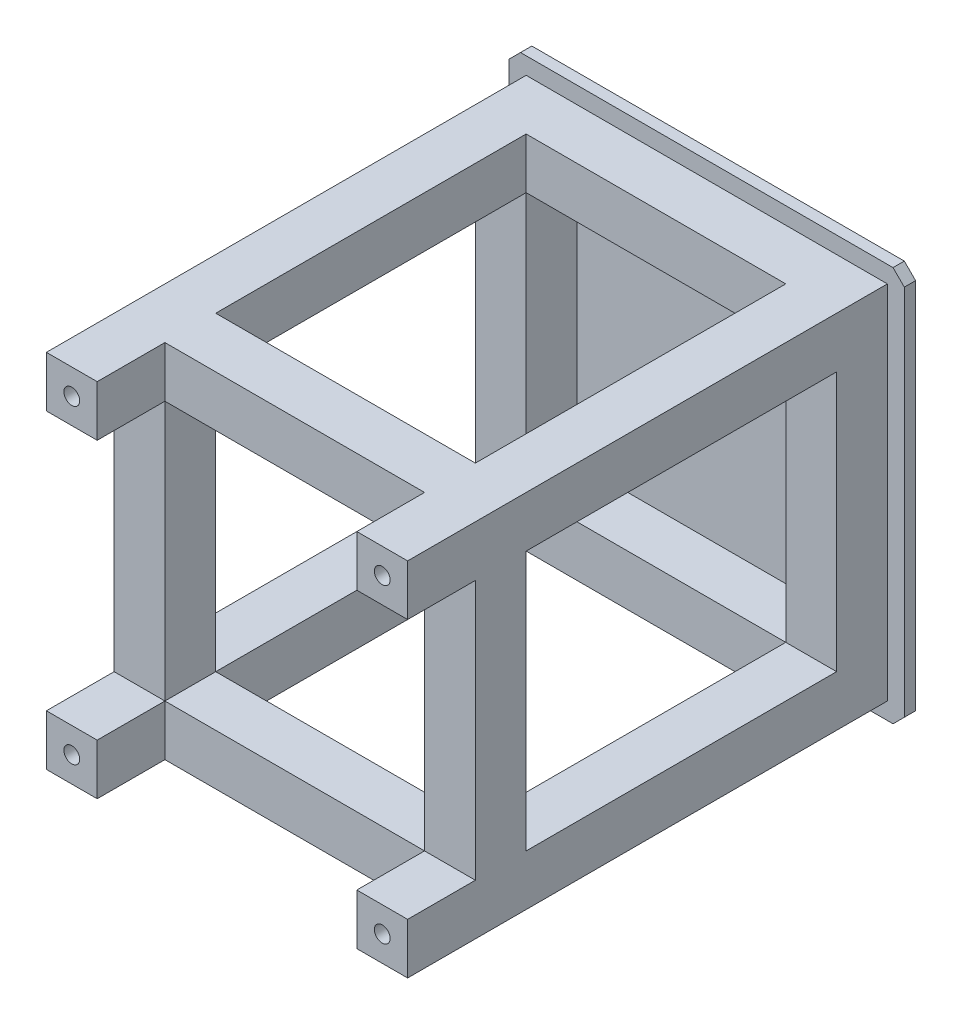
ISO-10303-21;
HEADER;
FILE_DESCRIPTION(('STEP AP214'),'2;1');
FILE_NAME('part.step','',(''),(''),'','','');
FILE_SCHEMA(('AUTOMOTIVE_DESIGN { 1 0 10303 214 1 1 1 1 }'));
ENDSEC;
DATA;
#1=APPLICATION_CONTEXT('core data for automotive mechanical design processes');
#2=APPLICATION_PROTOCOL_DEFINITION('international standard','automotive_design',2000,#1);
#3=PRODUCT_CONTEXT('',#1,'mechanical');
#4=PRODUCT('Part','Part','',(#3));
#5=PRODUCT_RELATED_PRODUCT_CATEGORY('part','',(#4));
#6=PRODUCT_DEFINITION_FORMATION('','',#4);
#7=PRODUCT_DEFINITION_CONTEXT('part definition',#1,'design');
#8=PRODUCT_DEFINITION('design','',#6,#7);
#9=PRODUCT_DEFINITION_SHAPE('','',#8);
#10=(LENGTH_UNIT() NAMED_UNIT(*) SI_UNIT(.MILLI.,.METRE.));
#11=(NAMED_UNIT(*) PLANE_ANGLE_UNIT() SI_UNIT($,.RADIAN.));
#12=(NAMED_UNIT(*) SI_UNIT($,.STERADIAN.) SOLID_ANGLE_UNIT());
#13=UNCERTAINTY_MEASURE_WITH_UNIT(LENGTH_MEASURE(1.E-05),#10,'distance_accuracy_value','');
#14=(GEOMETRIC_REPRESENTATION_CONTEXT(3) GLOBAL_UNCERTAINTY_ASSIGNED_CONTEXT((#13)) GLOBAL_UNIT_ASSIGNED_CONTEXT((#10,
#11,#12)) REPRESENTATION_CONTEXT('',''));
#15=CARTESIAN_POINT('',(0.,0.,0.));
#16=DIRECTION('',(0.,0.,1.));
#17=DIRECTION('',(1.,0.,0.));
#18=AXIS2_PLACEMENT_3D('',#15,#16,#17);
#19=CARTESIAN_POINT('',(-160.,115.,435.));
#20=DIRECTION('',(0.,1.,0.));
#21=DIRECTION('',(-1.,0.,0.));
#22=AXIS2_PLACEMENT_3D('',#19,#20,#21);
#23=PLANE('',#22);
#24=DIRECTION('',(-1.,0.,0.));
#25=VECTOR('',#24,1.);
#26=CARTESIAN_POINT('',(-160.,115.,375.));
#27=LINE('',#26,#25);
#28=CARTESIAN_POINT('',(-115.,115.,375.));
#29=VERTEX_POINT('',#28);
#30=CARTESIAN_POINT('',(-160.,115.,375.));
#31=VERTEX_POINT('',#30);
#32=EDGE_CURVE('E267',#29,#31,#27,.T.);
#33=ORIENTED_EDGE('',*,*,#32,.F.);
#34=DIRECTION('',(0.,0.,-1.));
#35=VECTOR('',#34,1.);
#36=CARTESIAN_POINT('',(-115.,115.,435.));
#37=LINE('',#36,#35);
#38=CARTESIAN_POINT('',(-115.,115.,435.));
#39=VERTEX_POINT('',#38);
#40=EDGE_CURVE('E340',#39,#29,#37,.T.);
#41=ORIENTED_EDGE('',*,*,#40,.F.);
#42=DIRECTION('',(1.,0.,0.));
#43=VECTOR('',#42,1.);
#44=CARTESIAN_POINT('',(-160.,115.,435.));
#45=LINE('',#44,#43);
#46=CARTESIAN_POINT('',(-160.,115.,435.));
#47=VERTEX_POINT('',#46);
#48=EDGE_CURVE('E329',#47,#39,#45,.T.);
#49=ORIENTED_EDGE('',*,*,#48,.F.);
#50=DIRECTION('',(0.,0.,-1.));
#51=VECTOR('',#50,1.);
#52=CARTESIAN_POINT('',(-160.,115.,435.));
#53=LINE('',#52,#51);
#54=EDGE_CURVE('E361',#47,#31,#53,.T.);
#55=ORIENTED_EDGE('',*,*,#54,.T.);
#56=EDGE_LOOP('',(#33,#41,#49,#55));
#57=FACE_BOUND('',#56,.T.);
#58=ADVANCED_FACE('F16',(#57),#23,.F.);
#59=DIRECTION('',(0.,0.,-1.));
#60=VECTOR('',#59,1.);
#61=CARTESIAN_POINT('',(-115.,115.,375.));
#62=LINE('',#61,#60);
#63=CARTESIAN_POINT('',(-115.,115.,330.));
#64=VERTEX_POINT('',#63);
#65=EDGE_CURVE('E550',#29,#64,#62,.T.);
#66=ORIENTED_EDGE('',*,*,#65,.T.);
#67=DIRECTION('',(1.,0.,0.));
#68=VECTOR('',#67,1.);
#69=CARTESIAN_POINT('',(-160.,115.,330.));
#70=LINE('',#69,#68);
#71=CARTESIAN_POINT('',(115.,115.,330.));
#72=VERTEX_POINT('',#71);
#73=EDGE_CURVE('E534',#64,#72,#70,.T.);
#74=ORIENTED_EDGE('',*,*,#73,.T.);
#75=DIRECTION('',(0.,0.,-1.));
#76=VECTOR('',#75,1.);
#77=CARTESIAN_POINT('',(115.,115.,375.));
#78=LINE('',#77,#76);
#79=CARTESIAN_POINT('',(115.,115.,375.));
#80=VERTEX_POINT('',#79);
#81=EDGE_CURVE('E589',#80,#72,#78,.T.);
#82=ORIENTED_EDGE('',*,*,#81,.F.);
#83=DIRECTION('',(1.,0.,0.));
#84=VECTOR('',#83,1.);
#85=CARTESIAN_POINT('',(-160.,115.,375.));
#86=LINE('',#85,#84);
#87=EDGE_CURVE('E613',#29,#80,#86,.T.);
#88=ORIENTED_EDGE('',*,*,#87,.F.);
#89=EDGE_LOOP('',(#66,#74,#82,#88));
#90=FACE_BOUND('',#89,.T.);
#91=ADVANCED_FACE('F478',(#90),#23,.F.);
#92=CARTESIAN_POINT('',(-160.,-115.,435.));
#93=DIRECTION('',(0.,-1.,0.));
#94=DIRECTION('',(1.,0.,0.));
#95=AXIS2_PLACEMENT_3D('',#92,#93,#94);
#96=PLANE('',#95);
#97=DIRECTION('',(1.,0.,0.));
#98=VECTOR('',#97,1.);
#99=CARTESIAN_POINT('',(-160.,-115.,375.));
#100=LINE('',#99,#98);
#101=CARTESIAN_POINT('',(-160.,-115.,375.));
#102=VERTEX_POINT('',#101);
#103=CARTESIAN_POINT('',(-115.,-115.,375.));
#104=VERTEX_POINT('',#103);
#105=EDGE_CURVE('E265',#102,#104,#100,.T.);
#106=ORIENTED_EDGE('',*,*,#105,.F.);
#107=DIRECTION('',(0.,0.,-1.));
#108=VECTOR('',#107,1.);
#109=CARTESIAN_POINT('',(-160.,-115.,435.));
#110=LINE('',#109,#108);
#111=CARTESIAN_POINT('',(-160.,-115.,435.));
#112=VERTEX_POINT('',#111);
#113=EDGE_CURVE('E277',#112,#102,#110,.T.);
#114=ORIENTED_EDGE('',*,*,#113,.F.);
#115=DIRECTION('',(-1.,0.,0.));
#116=VECTOR('',#115,1.);
#117=CARTESIAN_POINT('',(-160.,-115.,435.));
#118=LINE('',#117,#116);
#119=CARTESIAN_POINT('',(-115.,-115.,435.));
#120=VERTEX_POINT('',#119);
#121=EDGE_CURVE('E291',#120,#112,#118,.T.);
#122=ORIENTED_EDGE('',*,*,#121,.F.);
#123=DIRECTION('',(0.,0.,-1.));
#124=VECTOR('',#123,1.);
#125=CARTESIAN_POINT('',(-115.,-115.,435.));
#126=LINE('',#125,#124);
#127=EDGE_CURVE('E280',#120,#104,#126,.T.);
#128=ORIENTED_EDGE('',*,*,#127,.T.);
#129=EDGE_LOOP('',(#106,#114,#122,#128));
#130=FACE_BOUND('',#129,.T.);
#131=ADVANCED_FACE('F275',(#130),#96,.F.);
#132=DIRECTION('',(0.,0.,-1.));
#133=VECTOR('',#132,1.);
#134=CARTESIAN_POINT('',(-115.,-115.,375.));
#135=LINE('',#134,#133);
#136=CARTESIAN_POINT('',(-115.,-115.,330.));
#137=VERTEX_POINT('',#136);
#138=EDGE_CURVE('E552',#104,#137,#135,.T.);
#139=ORIENTED_EDGE('',*,*,#138,.F.);
#140=DIRECTION('',(-1.,0.,0.));
#141=VECTOR('',#140,1.);
#142=CARTESIAN_POINT('',(-160.,-115.,375.));
#143=LINE('',#142,#141);
#144=CARTESIAN_POINT('',(115.,-115.,375.));
#145=VERTEX_POINT('',#144);
#146=EDGE_CURVE('E596',#145,#104,#143,.T.);
#147=ORIENTED_EDGE('',*,*,#146,.F.);
#148=DIRECTION('',(0.,0.,-1.));
#149=VECTOR('',#148,1.);
#150=CARTESIAN_POINT('',(115.,-115.,375.));
#151=LINE('',#150,#149);
#152=CARTESIAN_POINT('',(115.,-115.,330.));
#153=VERTEX_POINT('',#152);
#154=EDGE_CURVE('E577',#145,#153,#151,.T.);
#155=ORIENTED_EDGE('',*,*,#154,.T.);
#156=DIRECTION('',(-1.,0.,0.));
#157=VECTOR('',#156,1.);
#158=CARTESIAN_POINT('',(-160.,-115.,330.));
#159=LINE('',#158,#157);
#160=EDGE_CURVE('E597',#153,#137,#159,.T.);
#161=ORIENTED_EDGE('',*,*,#160,.T.);
#162=EDGE_LOOP('',(#139,#147,#155,#161));
#163=FACE_BOUND('',#162,.T.);
#164=ADVANCED_FACE('F517',(#163),#96,.F.);
#165=DIRECTION('',(-1.,0.,0.));
#166=VECTOR('',#165,1.);
#167=CARTESIAN_POINT('',(160.,115.,375.));
#168=LINE('',#167,#166);
#169=CARTESIAN_POINT('',(160.,115.,375.));
#170=VERTEX_POINT('',#169);
#171=EDGE_CURVE('E570',#170,#80,#168,.T.);
#172=ORIENTED_EDGE('',*,*,#171,.F.);
#173=DIRECTION('',(0.,0.,-1.));
#174=VECTOR('',#173,1.);
#175=CARTESIAN_POINT('',(160.,115.,435.));
#176=LINE('',#175,#174);
#177=CARTESIAN_POINT('',(160.,115.,435.));
#178=VERTEX_POINT('',#177);
#179=EDGE_CURVE('E315',#178,#170,#176,.T.);
#180=ORIENTED_EDGE('',*,*,#179,.F.);
#181=DIRECTION('',(1.,0.,0.));
#182=VECTOR('',#181,1.);
#183=CARTESIAN_POINT('',(160.,115.,435.));
#184=LINE('',#183,#182);
#185=CARTESIAN_POINT('',(115.,115.,435.));
#186=VERTEX_POINT('',#185);
#187=EDGE_CURVE('E308',#186,#178,#184,.T.);
#188=ORIENTED_EDGE('',*,*,#187,.F.);
#189=DIRECTION('',(0.,0.,-1.));
#190=VECTOR('',#189,1.);
#191=CARTESIAN_POINT('',(115.,115.,435.));
#192=LINE('',#191,#190);
#193=EDGE_CURVE('E319',#186,#80,#192,.T.);
#194=ORIENTED_EDGE('',*,*,#193,.T.);
#195=EDGE_LOOP('',(#172,#180,#188,#194));
#196=FACE_BOUND('',#195,.T.);
#197=ADVANCED_FACE('F487',(#196),#23,.F.);
#198=CARTESIAN_POINT('',(-115.,115.,55.));
#199=VERTEX_POINT('',#198);
#200=EDGE_CURVE('E351',#64,#199,#37,.T.);
#201=ORIENTED_EDGE('',*,*,#200,.F.);
#202=DIRECTION('',(-1.,0.,0.));
#203=VECTOR('',#202,1.);
#204=CARTESIAN_POINT('',(-160.,115.,330.));
#205=LINE('',#204,#203);
#206=CARTESIAN_POINT('',(-160.,115.,330.));
#207=VERTEX_POINT('',#206);
#208=EDGE_CURVE('E524',#64,#207,#205,.T.);
#209=ORIENTED_EDGE('',*,*,#208,.T.);
#210=CARTESIAN_POINT('',(-160.,115.,55.));
#211=VERTEX_POINT('',#210);
#212=EDGE_CURVE('E359',#207,#211,#53,.T.);
#213=ORIENTED_EDGE('',*,*,#212,.T.);
#214=DIRECTION('',(1.,0.,0.));
#215=VECTOR('',#214,1.);
#216=CARTESIAN_POINT('',(-160.,115.,55.));
#217=LINE('',#216,#215);
#218=EDGE_CURVE('E325',#211,#199,#217,.T.);
#219=ORIENTED_EDGE('',*,*,#218,.T.);
#220=EDGE_LOOP('',(#201,#209,#213,#219));
#221=FACE_BOUND('',#220,.T.);
#222=ADVANCED_FACE('F494',(#221),#23,.F.);
#223=DIRECTION('',(1.,0.,0.));
#224=VECTOR('',#223,1.);
#225=CARTESIAN_POINT('',(160.,-115.,375.));
#226=LINE('',#225,#224);
#227=CARTESIAN_POINT('',(160.,-115.,375.));
#228=VERTEX_POINT('',#227);
#229=EDGE_CURVE('E575',#145,#228,#226,.T.);
#230=ORIENTED_EDGE('',*,*,#229,.F.);
#231=DIRECTION('',(0.,0.,-1.));
#232=VECTOR('',#231,1.);
#233=CARTESIAN_POINT('',(115.,-115.,435.));
#234=LINE('',#233,#232);
#235=CARTESIAN_POINT('',(115.,-115.,435.));
#236=VERTEX_POINT('',#235);
#237=EDGE_CURVE('E668',#236,#145,#234,.T.);
#238=ORIENTED_EDGE('',*,*,#237,.F.);
#239=DIRECTION('',(-1.,0.,0.));
#240=VECTOR('',#239,1.);
#241=CARTESIAN_POINT('',(115.,-115.,435.));
#242=LINE('',#241,#240);
#243=CARTESIAN_POINT('',(160.,-115.,435.));
#244=VERTEX_POINT('',#243);
#245=EDGE_CURVE('E661',#244,#236,#242,.T.);
#246=ORIENTED_EDGE('',*,*,#245,.F.);
#247=DIRECTION('',(0.,0.,-1.));
#248=VECTOR('',#247,1.);
#249=CARTESIAN_POINT('',(160.,-115.,435.));
#250=LINE('',#249,#248);
#251=EDGE_CURVE('E672',#244,#228,#250,.T.);
#252=ORIENTED_EDGE('',*,*,#251,.T.);
#253=EDGE_LOOP('',(#230,#238,#246,#252));
#254=FACE_BOUND('',#253,.T.);
#255=ADVANCED_FACE('F507',(#254),#96,.F.);
#256=CARTESIAN_POINT('',(-160.,-115.,330.));
#257=VERTEX_POINT('',#256);
#258=CARTESIAN_POINT('',(-160.,-115.,55.));
#259=VERTEX_POINT('',#258);
#260=EDGE_CURVE('E288',#257,#259,#110,.T.);
#261=ORIENTED_EDGE('',*,*,#260,.F.);
#262=DIRECTION('',(1.,0.,0.));
#263=VECTOR('',#262,1.);
#264=CARTESIAN_POINT('',(-160.,-115.,330.));
#265=LINE('',#264,#263);
#266=EDGE_CURVE('E555',#257,#137,#265,.T.);
#267=ORIENTED_EDGE('',*,*,#266,.T.);
#268=CARTESIAN_POINT('',(-115.,-115.,55.));
#269=VERTEX_POINT('',#268);
#270=EDGE_CURVE('E287',#137,#269,#126,.T.);
#271=ORIENTED_EDGE('',*,*,#270,.T.);
#272=DIRECTION('',(-1.,0.,0.));
#273=VECTOR('',#272,1.);
#274=CARTESIAN_POINT('',(-160.,-115.,55.));
#275=LINE('',#274,#273);
#276=EDGE_CURVE('E293',#269,#259,#275,.T.);
#277=ORIENTED_EDGE('',*,*,#276,.T.);
#278=EDGE_LOOP('',(#261,#267,#271,#277));
#279=FACE_BOUND('',#278,.T.);
#280=ADVANCED_FACE('F514',(#279),#96,.F.);
#281=CARTESIAN_POINT('',(-115.,-160.,435.));
#282=DIRECTION('',(-1.,0.,0.));
#283=DIRECTION('',(0.,0.,1.));
#284=AXIS2_PLACEMENT_3D('',#281,#282,#283);
#285=PLANE('',#284);
#286=DIRECTION('',(0.,1.,0.));
#287=VECTOR('',#286,1.);
#288=CARTESIAN_POINT('',(-115.,-160.,330.));
#289=LINE('',#288,#287);
#290=CARTESIAN_POINT('',(-115.,-160.,330.));
#291=VERTEX_POINT('',#290);
#292=EDGE_CURVE('E543',#291,#137,#289,.T.);
#293=ORIENTED_EDGE('',*,*,#292,.F.);
#294=DIRECTION('',(0.,0.,-1.));
#295=VECTOR('',#294,1.);
#296=CARTESIAN_POINT('',(-115.,-160.,435.));
#297=LINE('',#296,#295);
#298=CARTESIAN_POINT('',(-115.,-160.,55.));
#299=VERTEX_POINT('',#298);
#300=EDGE_CURVE('E296',#291,#299,#297,.T.);
#301=ORIENTED_EDGE('',*,*,#300,.T.);
#302=DIRECTION('',(0.,1.,0.));
#303=VECTOR('',#302,1.);
#304=CARTESIAN_POINT('',(-115.,-160.,55.));
#305=LINE('',#304,#303);
#306=EDGE_CURVE('E679',#299,#269,#305,.T.);
#307=ORIENTED_EDGE('',*,*,#306,.T.);
#308=ORIENTED_EDGE('',*,*,#270,.F.);
#309=EDGE_LOOP('',(#293,#301,#307,#308));
#310=FACE_BOUND('',#309,.T.);
#311=ADVANCED_FACE('F792',(#310),#285,.F.);
#312=CARTESIAN_POINT('',(115.,-115.,435.));
#313=DIRECTION('',(1.,0.,0.));
#314=DIRECTION('',(0.,0.,-1.));
#315=AXIS2_PLACEMENT_3D('',#312,#313,#314);
#316=PLANE('',#315);
#317=DIRECTION('',(0.,-1.,0.));
#318=VECTOR('',#317,1.);
#319=CARTESIAN_POINT('',(115.,-115.,330.));
#320=LINE('',#319,#318);
#321=CARTESIAN_POINT('',(115.,-160.,330.));
#322=VERTEX_POINT('',#321);
#323=EDGE_CURVE('E608',#153,#322,#320,.T.);
#324=ORIENTED_EDGE('',*,*,#323,.F.);
#325=CARTESIAN_POINT('',(115.,-115.,55.));
#326=VERTEX_POINT('',#325);
#327=EDGE_CURVE('E663',#153,#326,#234,.T.);
#328=ORIENTED_EDGE('',*,*,#327,.T.);
#329=DIRECTION('',(0.,-1.,0.));
#330=VECTOR('',#329,1.);
#331=CARTESIAN_POINT('',(115.,-115.,55.));
#332=LINE('',#331,#330);
#333=CARTESIAN_POINT('',(115.,-160.,55.));
#334=VERTEX_POINT('',#333);
#335=EDGE_CURVE('E651',#326,#334,#332,.T.);
#336=ORIENTED_EDGE('',*,*,#335,.T.);
#337=DIRECTION('',(0.,0.,-1.));
#338=VECTOR('',#337,1.);
#339=CARTESIAN_POINT('',(115.,-160.,435.));
#340=LINE('',#339,#338);
#341=EDGE_CURVE('E675',#322,#334,#340,.T.);
#342=ORIENTED_EDGE('',*,*,#341,.F.);
#343=EDGE_LOOP('',(#324,#328,#336,#342));
#344=FACE_BOUND('',#343,.T.);
#345=ADVANCED_FACE('F795',(#344),#316,.F.);
#346=CARTESIAN_POINT('',(-115.,160.,435.));
#347=DIRECTION('',(-1.,0.,0.));
#348=DIRECTION('',(0.,-1.,0.));
#349=AXIS2_PLACEMENT_3D('',#346,#347,#348);
#350=PLANE('',#349);
#351=DIRECTION('',(0.,1.,0.));
#352=VECTOR('',#351,1.);
#353=CARTESIAN_POINT('',(-115.,160.,330.));
#354=LINE('',#353,#352);
#355=CARTESIAN_POINT('',(-115.,160.,330.));
#356=VERTEX_POINT('',#355);
#357=EDGE_CURVE('E538',#64,#356,#354,.T.);
#358=ORIENTED_EDGE('',*,*,#357,.F.);
#359=ORIENTED_EDGE('',*,*,#200,.T.);
#360=DIRECTION('',(0.,1.,0.));
#361=VECTOR('',#360,1.);
#362=CARTESIAN_POINT('',(-115.,160.,55.));
#363=LINE('',#362,#361);
#364=CARTESIAN_POINT('',(-115.,160.,55.));
#365=VERTEX_POINT('',#364);
#366=EDGE_CURVE('E330',#199,#365,#363,.T.);
#367=ORIENTED_EDGE('',*,*,#366,.T.);
#368=DIRECTION('',(0.,0.,-1.));
#369=VECTOR('',#368,1.);
#370=CARTESIAN_POINT('',(-115.,160.,435.));
#371=LINE('',#370,#369);
#372=EDGE_CURVE('E337',#356,#365,#371,.T.);
#373=ORIENTED_EDGE('',*,*,#372,.F.);
#374=EDGE_LOOP('',(#358,#359,#367,#373));
#375=FACE_BOUND('',#374,.T.);
#376=ADVANCED_FACE('F502',(#375),#350,.F.);
#377=CARTESIAN_POINT('',(115.,160.,435.));
#378=DIRECTION('',(1.,0.,0.));
#379=DIRECTION('',(0.,1.,0.));
#380=AXIS2_PLACEMENT_3D('',#377,#378,#379);
#381=PLANE('',#380);
#382=DIRECTION('',(0.,-1.,0.));
#383=VECTOR('',#382,1.);
#384=CARTESIAN_POINT('',(115.,160.,330.));
#385=LINE('',#384,#383);
#386=CARTESIAN_POINT('',(115.,160.,330.));
#387=VERTEX_POINT('',#386);
#388=EDGE_CURVE('E540',#387,#72,#385,.T.);
#389=ORIENTED_EDGE('',*,*,#388,.F.);
#390=DIRECTION('',(0.,0.,-1.));
#391=VECTOR('',#390,1.);
#392=CARTESIAN_POINT('',(115.,160.,435.));
#393=LINE('',#392,#391);
#394=CARTESIAN_POINT('',(115.,160.,55.));
#395=VERTEX_POINT('',#394);
#396=EDGE_CURVE('E322',#387,#395,#393,.T.);
#397=ORIENTED_EDGE('',*,*,#396,.T.);
#398=DIRECTION('',(0.,-1.,0.));
#399=VECTOR('',#398,1.);
#400=CARTESIAN_POINT('',(115.,160.,55.));
#401=LINE('',#400,#399);
#402=CARTESIAN_POINT('',(115.,115.,55.));
#403=VERTEX_POINT('',#402);
#404=EDGE_CURVE('E299',#395,#403,#401,.T.);
#405=ORIENTED_EDGE('',*,*,#404,.T.);
#406=EDGE_CURVE('E318',#72,#403,#192,.T.);
#407=ORIENTED_EDGE('',*,*,#406,.F.);
#408=EDGE_LOOP('',(#389,#397,#405,#407));
#409=FACE_BOUND('',#408,.T.);
#410=ADVANCED_FACE('F929',(#409),#381,.F.);
#411=CARTESIAN_POINT('',(0.,0.,55.));
#412=DIRECTION('',(0.,0.,1.));
#413=DIRECTION('',(1.,0.,0.));
#414=AXIS2_PLACEMENT_3D('',#411,#412,#413);
#415=PLANE('',#414);
#416=DIRECTION('',(1.,0.,0.));
#417=VECTOR('',#416,1.);
#418=CARTESIAN_POINT('',(-160.,-160.,55.));
#419=LINE('',#418,#417);
#420=EDGE_CURVE('E724',#299,#334,#419,.T.);
#421=ORIENTED_EDGE('',*,*,#420,.T.);
#422=ORIENTED_EDGE('',*,*,#335,.F.);
#423=DIRECTION('',(-1.,0.,0.));
#424=VECTOR('',#423,1.);
#425=CARTESIAN_POINT('',(-160.,-115.,55.));
#426=LINE('',#425,#424);
#427=EDGE_CURVE('E713',#326,#269,#426,.T.);
#428=ORIENTED_EDGE('',*,*,#427,.T.);
#429=ORIENTED_EDGE('',*,*,#306,.F.);
#430=EDGE_LOOP('',(#421,#422,#428,#429));
#431=FACE_BOUND('',#430,.T.);
#432=ADVANCED_FACE('F721',(#431),#415,.T.);
#433=DIRECTION('',(0.,-1.,0.));
#434=VECTOR('',#433,1.);
#435=CARTESIAN_POINT('',(115.,115.,55.));
#436=LINE('',#435,#434);
#437=EDGE_CURVE('E741',#403,#326,#436,.T.);
#438=ORIENTED_EDGE('',*,*,#437,.T.);
#439=DIRECTION('',(-1.,0.,0.));
#440=VECTOR('',#439,1.);
#441=CARTESIAN_POINT('',(115.,-115.,55.));
#442=LINE('',#441,#440);
#443=CARTESIAN_POINT('',(160.,-115.,55.));
#444=VERTEX_POINT('',#443);
#445=EDGE_CURVE('E656',#444,#326,#442,.T.);
#446=ORIENTED_EDGE('',*,*,#445,.F.);
#447=DIRECTION('',(0.,1.,0.));
#448=VECTOR('',#447,1.);
#449=CARTESIAN_POINT('',(160.,160.,55.));
#450=LINE('',#449,#448);
#451=CARTESIAN_POINT('',(160.,115.,55.));
#452=VERTEX_POINT('',#451);
#453=EDGE_CURVE('E428',#444,#452,#450,.T.);
#454=ORIENTED_EDGE('',*,*,#453,.T.);
#455=DIRECTION('',(1.,0.,0.));
#456=VECTOR('',#455,1.);
#457=CARTESIAN_POINT('',(160.,115.,55.));
#458=LINE('',#457,#456);
#459=EDGE_CURVE('E304',#403,#452,#458,.T.);
#460=ORIENTED_EDGE('',*,*,#459,.F.);
#461=EDGE_LOOP('',(#438,#446,#454,#460));
#462=FACE_BOUND('',#461,.T.);
#463=ADVANCED_FACE('F804',(#462),#415,.T.);
#464=DIRECTION('',(0.,-1.,0.));
#465=VECTOR('',#464,1.);
#466=CARTESIAN_POINT('',(-160.,160.,55.));
#467=LINE('',#466,#465);
#468=EDGE_CURVE('E414',#211,#259,#467,.T.);
#469=ORIENTED_EDGE('',*,*,#468,.T.);
#470=ORIENTED_EDGE('',*,*,#276,.F.);
#471=DIRECTION('',(0.,1.,0.));
#472=VECTOR('',#471,1.);
#473=CARTESIAN_POINT('',(-115.,115.,55.));
#474=LINE('',#473,#472);
#475=EDGE_CURVE('E697',#269,#199,#474,.T.);
#476=ORIENTED_EDGE('',*,*,#475,.T.);
#477=ORIENTED_EDGE('',*,*,#218,.F.);
#478=EDGE_LOOP('',(#469,#470,#476,#477));
#479=FACE_BOUND('',#478,.T.);
#480=ADVANCED_FACE('F696',(#479),#415,.T.);
#481=DIRECTION('',(1.,0.,0.));
#482=VECTOR('',#481,1.);
#483=CARTESIAN_POINT('',(-160.,115.,55.));
#484=LINE('',#483,#482);
#485=EDGE_CURVE('E418',#199,#403,#484,.T.);
#486=ORIENTED_EDGE('',*,*,#485,.T.);
#487=ORIENTED_EDGE('',*,*,#404,.F.);
#488=DIRECTION('',(-1.,0.,0.));
#489=VECTOR('',#488,1.);
#490=CARTESIAN_POINT('',(-160.,160.,55.));
#491=LINE('',#490,#489);
#492=EDGE_CURVE('E354',#395,#365,#491,.T.);
#493=ORIENTED_EDGE('',*,*,#492,.T.);
#494=ORIENTED_EDGE('',*,*,#366,.F.);
#495=EDGE_LOOP('',(#486,#487,#493,#494));
#496=FACE_BOUND('',#495,.T.);
#497=ADVANCED_FACE('F812',(#496),#415,.T.);
#498=CARTESIAN_POINT('',(0.,0.,10.));
#499=DIRECTION('',(0.,0.,1.));
#500=DIRECTION('',(1.,0.,0.));
#501=AXIS2_PLACEMENT_3D('',#498,#499,#500);
#502=PLANE('',#501);
#503=DIRECTION('',(0.,1.,0.));
#504=VECTOR('',#503,1.);
#505=CARTESIAN_POINT('',(175.,175.,10.));
#506=LINE('',#505,#504);
#507=CARTESIAN_POINT('',(175.,-165.,10.));
#508=VERTEX_POINT('',#507);
#509=CARTESIAN_POINT('',(175.,165.,10.));
#510=VERTEX_POINT('',#509);
#511=EDGE_CURVE('E404',#508,#510,#506,.T.);
#512=ORIENTED_EDGE('',*,*,#511,.T.);
#513=DIRECTION('',(0.707106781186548,-0.707106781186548,0.));
#514=VECTOR('',#513,1.);
#515=CARTESIAN_POINT('',(170.,170.,10.));
#516=LINE('',#515,#514);
#517=CARTESIAN_POINT('',(165.,175.,10.));
#518=VERTEX_POINT('',#517);
#519=EDGE_CURVE('E386',#510,#518,#516,.F.);
#520=ORIENTED_EDGE('',*,*,#519,.T.);
#521=DIRECTION('',(-1.,0.,0.));
#522=VECTOR('',#521,1.);
#523=CARTESIAN_POINT('',(-175.,175.,10.));
#524=LINE('',#523,#522);
#525=CARTESIAN_POINT('',(-165.,175.,10.));
#526=VERTEX_POINT('',#525);
#527=EDGE_CURVE('E408',#518,#526,#524,.T.);
#528=ORIENTED_EDGE('',*,*,#527,.T.);
#529=DIRECTION('',(0.70710678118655,0.707106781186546,0.));
#530=VECTOR('',#529,1.);
#531=CARTESIAN_POINT('',(-170.,170.,10.));
#532=LINE('',#531,#530);
#533=CARTESIAN_POINT('',(-175.,165.,10.));
#534=VERTEX_POINT('',#533);
#535=EDGE_CURVE('E384',#526,#534,#532,.F.);
#536=ORIENTED_EDGE('',*,*,#535,.T.);
#537=DIRECTION('',(0.,-1.,0.));
#538=VECTOR('',#537,1.);
#539=CARTESIAN_POINT('',(-175.,175.,10.));
#540=LINE('',#539,#538);
#541=CARTESIAN_POINT('',(-175.,-165.,10.));
#542=VERTEX_POINT('',#541);
#543=EDGE_CURVE('E449',#534,#542,#540,.T.);
#544=ORIENTED_EDGE('',*,*,#543,.T.);
#545=DIRECTION('',(-0.707106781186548,0.707106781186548,0.));
#546=VECTOR('',#545,1.);
#547=CARTESIAN_POINT('',(-170.,-170.,10.));
#548=LINE('',#547,#546);
#549=CARTESIAN_POINT('',(-165.,-175.,10.));
#550=VERTEX_POINT('',#549);
#551=EDGE_CURVE('E36',#542,#550,#548,.F.);
#552=ORIENTED_EDGE('',*,*,#551,.T.);
#553=DIRECTION('',(1.,0.,0.));
#554=VECTOR('',#553,1.);
#555=CARTESIAN_POINT('',(-175.,-175.,10.));
#556=LINE('',#555,#554);
#557=CARTESIAN_POINT('',(165.,-175.,10.));
#558=VERTEX_POINT('',#557);
#559=EDGE_CURVE('E365',#550,#558,#556,.T.);
#560=ORIENTED_EDGE('',*,*,#559,.T.);
#561=DIRECTION('',(-0.707106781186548,-0.707106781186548,0.));
#562=VECTOR('',#561,1.);
#563=CARTESIAN_POINT('',(170.,-170.,10.));
#564=LINE('',#563,#562);
#565=EDGE_CURVE('E382',#558,#508,#564,.F.);
#566=ORIENTED_EDGE('',*,*,#565,.T.);
#567=EDGE_LOOP('',(#512,#520,#528,#536,#544,#552,#560,#566));
#568=FACE_BOUND('',#567,.T.);
#569=DIRECTION('',(1.,0.,0.));
#570=VECTOR('',#569,1.);
#571=CARTESIAN_POINT('',(-160.,-160.,10.));
#572=LINE('',#571,#570);
#573=CARTESIAN_POINT('',(-160.,-160.,10.));
#574=VERTEX_POINT('',#573);
#575=CARTESIAN_POINT('',(160.,-160.,10.));
#576=VERTEX_POINT('',#575);
#577=EDGE_CURVE('E729',#574,#576,#572,.T.);
#578=ORIENTED_EDGE('',*,*,#577,.F.);
#579=DIRECTION('',(0.,-1.,0.));
#580=VECTOR('',#579,1.);
#581=CARTESIAN_POINT('',(-160.,160.,10.));
#582=LINE('',#581,#580);
#583=CARTESIAN_POINT('',(-160.,160.,10.));
#584=VERTEX_POINT('',#583);
#585=EDGE_CURVE('E432',#584,#574,#582,.T.);
#586=ORIENTED_EDGE('',*,*,#585,.F.);
#587=DIRECTION('',(-1.,0.,0.));
#588=VECTOR('',#587,1.);
#589=CARTESIAN_POINT('',(-160.,160.,10.));
#590=LINE('',#589,#588);
#591=CARTESIAN_POINT('',(160.,160.,10.));
#592=VERTEX_POINT('',#591);
#593=EDGE_CURVE('E419',#592,#584,#590,.T.);
#594=ORIENTED_EDGE('',*,*,#593,.F.);
#595=DIRECTION('',(0.,1.,0.));
#596=VECTOR('',#595,1.);
#597=CARTESIAN_POINT('',(160.,160.,10.));
#598=LINE('',#597,#596);
#599=EDGE_CURVE('E437',#576,#592,#598,.T.);
#600=ORIENTED_EDGE('',*,*,#599,.F.);
#601=EDGE_LOOP('',(#578,#586,#594,#600));
#602=FACE_BOUND('',#601,.T.);
#603=ADVANCED_FACE('F464',(#568,#602),#502,.T.);
#604=DIRECTION('',(1.,0.,0.));
#605=VECTOR('',#604,1.);
#606=CARTESIAN_POINT('',(-160.,115.,10.));
#607=LINE('',#606,#605);
#608=CARTESIAN_POINT('',(-115.,115.,10.));
#609=VERTEX_POINT('',#608);
#610=CARTESIAN_POINT('',(115.,115.,10.));
#611=VERTEX_POINT('',#610);
#612=EDGE_CURVE('E435',#609,#611,#607,.T.);
#613=ORIENTED_EDGE('',*,*,#612,.F.);
#614=DIRECTION('',(0.,1.,0.));
#615=VECTOR('',#614,1.);
#616=CARTESIAN_POINT('',(-115.,115.,10.));
#617=LINE('',#616,#615);
#618=CARTESIAN_POINT('',(-115.,-115.,10.));
#619=VERTEX_POINT('',#618);
#620=EDGE_CURVE('E706',#619,#609,#617,.T.);
#621=ORIENTED_EDGE('',*,*,#620,.F.);
#622=DIRECTION('',(-1.,0.,0.));
#623=VECTOR('',#622,1.);
#624=CARTESIAN_POINT('',(-160.,-115.,10.));
#625=LINE('',#624,#623);
#626=CARTESIAN_POINT('',(115.,-115.,10.));
#627=VERTEX_POINT('',#626);
#628=EDGE_CURVE('E715',#627,#619,#625,.T.);
#629=ORIENTED_EDGE('',*,*,#628,.F.);
#630=DIRECTION('',(0.,-1.,0.));
#631=VECTOR('',#630,1.);
#632=CARTESIAN_POINT('',(115.,115.,10.));
#633=LINE('',#632,#631);
#634=EDGE_CURVE('E716',#611,#627,#633,.T.);
#635=ORIENTED_EDGE('',*,*,#634,.F.);
#636=EDGE_LOOP('',(#613,#621,#629,#635));
#637=FACE_BOUND('',#636,.T.);
#638=ADVANCED_FACE('F819',(#637),#502,.T.);
#639=CARTESIAN_POINT('',(-160.,115.,55.));
#640=DIRECTION('',(0.,1.,0.));
#641=DIRECTION('',(0.,0.,1.));
#642=AXIS2_PLACEMENT_3D('',#639,#640,#641);
#643=PLANE('',#642);
#644=DIRECTION('',(0.,0.,-1.));
#645=VECTOR('',#644,1.);
#646=CARTESIAN_POINT('',(-115.,115.,55.));
#647=LINE('',#646,#645);
#648=EDGE_CURVE('E705',#199,#609,#647,.T.);
#649=ORIENTED_EDGE('',*,*,#648,.T.);
#650=ORIENTED_EDGE('',*,*,#612,.T.);
#651=DIRECTION('',(0.,0.,-1.));
#652=VECTOR('',#651,1.);
#653=CARTESIAN_POINT('',(115.,115.,55.));
#654=LINE('',#653,#652);
#655=EDGE_CURVE('E732',#403,#611,#654,.T.);
#656=ORIENTED_EDGE('',*,*,#655,.F.);
#657=ORIENTED_EDGE('',*,*,#485,.F.);
#658=EDGE_LOOP('',(#649,#650,#656,#657));
#659=FACE_BOUND('',#658,.T.);
#660=ADVANCED_FACE('F816',(#659),#643,.F.);
#661=CARTESIAN_POINT('',(-160.,-115.,55.));
#662=DIRECTION('',(0.,-1.,0.));
#663=DIRECTION('',(0.,0.,-1.));
#664=AXIS2_PLACEMENT_3D('',#661,#662,#663);
#665=PLANE('',#664);
#666=DIRECTION('',(0.,0.,-1.));
#667=VECTOR('',#666,1.);
#668=CARTESIAN_POINT('',(-115.,-115.,55.));
#669=LINE('',#668,#667);
#670=EDGE_CURVE('E702',#269,#619,#669,.T.);
#671=ORIENTED_EDGE('',*,*,#670,.F.);
#672=ORIENTED_EDGE('',*,*,#427,.F.);
#673=DIRECTION('',(0.,0.,-1.));
#674=VECTOR('',#673,1.);
#675=CARTESIAN_POINT('',(115.,-115.,55.));
#676=LINE('',#675,#674);
#677=EDGE_CURVE('E736',#326,#627,#676,.T.);
#678=ORIENTED_EDGE('',*,*,#677,.T.);
#679=ORIENTED_EDGE('',*,*,#628,.T.);
#680=EDGE_LOOP('',(#671,#672,#678,#679));
#681=FACE_BOUND('',#680,.T.);
#682=ADVANCED_FACE('F711',(#681),#665,.F.);
#683=CARTESIAN_POINT('',(175.,175.,10.));
#684=DIRECTION('',(-1.,0.,0.));
#685=DIRECTION('',(0.,-1.,0.));
#686=AXIS2_PLACEMENT_3D('',#683,#684,#685);
#687=PLANE('',#686);
#688=DIRECTION('',(0.,1.,0.));
#689=VECTOR('',#688,1.);
#690=CARTESIAN_POINT('',(175.,175.,0.));
#691=LINE('',#690,#689);
#692=CARTESIAN_POINT('',(175.,-165.,0.));
#693=VERTEX_POINT('',#692);
#694=CARTESIAN_POINT('',(175.,165.,0.));
#695=VERTEX_POINT('',#694);
#696=EDGE_CURVE('E445',#693,#695,#691,.T.);
#697=ORIENTED_EDGE('',*,*,#696,.T.);
#698=DIRECTION('',(0.,0.,1.));
#699=VECTOR('',#698,1.);
#700=CARTESIAN_POINT('',(175.,165.,10.));
#701=LINE('',#700,#699);
#702=EDGE_CURVE('E379',#695,#510,#701,.T.);
#703=ORIENTED_EDGE('',*,*,#702,.T.);
#704=ORIENTED_EDGE('',*,*,#511,.F.);
#705=DIRECTION('',(0.,0.,-1.));
#706=VECTOR('',#705,1.);
#707=CARTESIAN_POINT('',(175.,-165.,10.));
#708=LINE('',#707,#706);
#709=EDGE_CURVE('E376',#508,#693,#708,.T.);
#710=ORIENTED_EDGE('',*,*,#709,.T.);
#711=EDGE_LOOP('',(#697,#703,#704,#710));
#712=FACE_BOUND('',#711,.T.);
#713=ADVANCED_FACE('F838',(#712),#687,.F.);
#714=CARTESIAN_POINT('',(-175.,175.,10.));
#715=DIRECTION('',(0.,-1.,0.));
#716=DIRECTION('',(0.,0.,-1.));
#717=AXIS2_PLACEMENT_3D('',#714,#715,#716);
#718=PLANE('',#717);
#719=ORIENTED_EDGE('',*,*,#527,.F.);
#720=DIRECTION('',(0.,0.,-1.));
#721=VECTOR('',#720,1.);
#722=CARTESIAN_POINT('',(165.,175.,10.));
#723=LINE('',#722,#721);
#724=CARTESIAN_POINT('',(165.,175.,0.));
#725=VERTEX_POINT('',#724);
#726=EDGE_CURVE('E364',#518,#725,#723,.T.);
#727=ORIENTED_EDGE('',*,*,#726,.T.);
#728=DIRECTION('',(-1.,0.,0.));
#729=VECTOR('',#728,1.);
#730=CARTESIAN_POINT('',(-175.,175.,0.));
#731=LINE('',#730,#729);
#732=CARTESIAN_POINT('',(-165.,175.,0.));
#733=VERTEX_POINT('',#732);
#734=EDGE_CURVE('E410',#725,#733,#731,.T.);
#735=ORIENTED_EDGE('',*,*,#734,.T.);
#736=DIRECTION('',(0.,0.,1.));
#737=VECTOR('',#736,1.);
#738=CARTESIAN_POINT('',(-165.,175.,10.));
#739=LINE('',#738,#737);
#740=EDGE_CURVE('E362',#733,#526,#739,.T.);
#741=ORIENTED_EDGE('',*,*,#740,.T.);
#742=EDGE_LOOP('',(#719,#727,#735,#741));
#743=FACE_BOUND('',#742,.T.);
#744=ADVANCED_FACE('F457',(#743),#718,.F.);
#745=CARTESIAN_POINT('',(-175.,175.,10.));
#746=DIRECTION('',(1.,0.,0.));
#747=DIRECTION('',(0.,1.,0.));
#748=AXIS2_PLACEMENT_3D('',#745,#746,#747);
#749=PLANE('',#748);
#750=ORIENTED_EDGE('',*,*,#543,.F.);
#751=DIRECTION('',(0.,0.,-1.));
#752=VECTOR('',#751,1.);
#753=CARTESIAN_POINT('',(-175.,165.,10.));
#754=LINE('',#753,#752);
#755=CARTESIAN_POINT('',(-175.,165.,0.));
#756=VERTEX_POINT('',#755);
#757=EDGE_CURVE('E390',#534,#756,#754,.T.);
#758=ORIENTED_EDGE('',*,*,#757,.T.);
#759=DIRECTION('',(0.,-1.,0.));
#760=VECTOR('',#759,1.);
#761=CARTESIAN_POINT('',(-175.,175.,0.));
#762=LINE('',#761,#760);
#763=CARTESIAN_POINT('',(-175.,-165.,0.));
#764=VERTEX_POINT('',#763);
#765=EDGE_CURVE('E405',#756,#764,#762,.T.);
#766=ORIENTED_EDGE('',*,*,#765,.T.);
#767=DIRECTION('',(0.,0.,1.));
#768=VECTOR('',#767,1.);
#769=CARTESIAN_POINT('',(-175.,-165.,10.));
#770=LINE('',#769,#768);
#771=EDGE_CURVE('E388',#764,#542,#770,.T.);
#772=ORIENTED_EDGE('',*,*,#771,.T.);
#773=EDGE_LOOP('',(#750,#758,#766,#772));
#774=FACE_BOUND('',#773,.T.);
#775=ADVANCED_FACE('F467',(#774),#749,.F.);
#776=CARTESIAN_POINT('',(-175.,-175.,10.));
#777=DIRECTION('',(0.,1.,0.));
#778=DIRECTION('',(0.,0.,1.));
#779=AXIS2_PLACEMENT_3D('',#776,#777,#778);
#780=PLANE('',#779);
#781=DIRECTION('',(1.,0.,0.));
#782=VECTOR('',#781,1.);
#783=CARTESIAN_POINT('',(-175.,-175.,0.));
#784=LINE('',#783,#782);
#785=CARTESIAN_POINT('',(-165.,-175.,0.));
#786=VERTEX_POINT('',#785);
#787=CARTESIAN_POINT('',(165.,-175.,0.));
#788=VERTEX_POINT('',#787);
#789=EDGE_CURVE('E396',#786,#788,#784,.T.);
#790=ORIENTED_EDGE('',*,*,#789,.T.);
#791=DIRECTION('',(0.,0.,1.));
#792=VECTOR('',#791,1.);
#793=CARTESIAN_POINT('',(165.,-175.,10.));
#794=LINE('',#793,#792);
#795=EDGE_CURVE('E11',#788,#558,#794,.T.);
#796=ORIENTED_EDGE('',*,*,#795,.T.);
#797=ORIENTED_EDGE('',*,*,#559,.F.);
#798=DIRECTION('',(0.,0.,-1.));
#799=VECTOR('',#798,1.);
#800=CARTESIAN_POINT('',(-165.,-175.,10.));
#801=LINE('',#800,#799);
#802=EDGE_CURVE('E24',#550,#786,#801,.T.);
#803=ORIENTED_EDGE('',*,*,#802,.T.);
#804=EDGE_LOOP('',(#790,#796,#797,#803));
#805=FACE_BOUND('',#804,.T.);
#806=ADVANCED_FACE('F395',(#805),#780,.F.);
#807=CARTESIAN_POINT('',(0.,0.,0.));
#808=DIRECTION('',(0.,0.,1.));
#809=DIRECTION('',(1.,0.,0.));
#810=AXIS2_PLACEMENT_3D('',#807,#808,#809);
#811=PLANE('',#810);
#812=ORIENTED_EDGE('',*,*,#734,.F.);
#813=DIRECTION('',(-0.707106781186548,0.707106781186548,0.));
#814=VECTOR('',#813,1.);
#815=CARTESIAN_POINT('',(165.,175.,0.));
#816=LINE('',#815,#814);
#817=EDGE_CURVE('E374',#725,#695,#816,.F.);
#818=ORIENTED_EDGE('',*,*,#817,.T.);
#819=ORIENTED_EDGE('',*,*,#696,.F.);
#820=DIRECTION('',(0.707106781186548,0.707106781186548,0.));
#821=VECTOR('',#820,1.);
#822=CARTESIAN_POINT('',(175.,-165.,0.));
#823=LINE('',#822,#821);
#824=EDGE_CURVE('E370',#693,#788,#823,.F.);
#825=ORIENTED_EDGE('',*,*,#824,.T.);
#826=ORIENTED_EDGE('',*,*,#789,.F.);
#827=DIRECTION('',(0.707106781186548,-0.707106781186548,0.));
#828=VECTOR('',#827,1.);
#829=CARTESIAN_POINT('',(-165.,-175.,0.));
#830=LINE('',#829,#828);
#831=EDGE_CURVE('E368',#786,#764,#830,.F.);
#832=ORIENTED_EDGE('',*,*,#831,.T.);
#833=ORIENTED_EDGE('',*,*,#765,.F.);
#834=DIRECTION('',(-0.70710678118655,-0.707106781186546,0.));
#835=VECTOR('',#834,1.);
#836=CARTESIAN_POINT('',(-175.,165.,0.));
#837=LINE('',#836,#835);
#838=EDGE_CURVE('E372',#756,#733,#837,.F.);
#839=ORIENTED_EDGE('',*,*,#838,.T.);
#840=EDGE_LOOP('',(#812,#818,#819,#825,#826,#832,#833,#839));
#841=FACE_BOUND('',#840,.T.);
#842=ADVANCED_FACE('F400',(#841),#811,.F.);
#843=CARTESIAN_POINT('',(-160.,160.,55.));
#844=DIRECTION('',(1.,0.,0.));
#845=DIRECTION('',(0.,0.,-1.));
#846=AXIS2_PLACEMENT_3D('',#843,#844,#845);
#847=PLANE('',#846);
#848=ORIENTED_EDGE('',*,*,#212,.F.);
#849=DIRECTION('',(0.,-1.,0.));
#850=VECTOR('',#849,1.);
#851=CARTESIAN_POINT('',(-160.,115.,330.));
#852=LINE('',#851,#850);
#853=EDGE_CURVE('E559',#207,#257,#852,.T.);
#854=ORIENTED_EDGE('',*,*,#853,.T.);
#855=ORIENTED_EDGE('',*,*,#260,.T.);
#856=ORIENTED_EDGE('',*,*,#468,.F.);
#857=EDGE_LOOP('',(#848,#854,#855,#856));
#858=FACE_BOUND('',#857,.T.);
#859=ORIENTED_EDGE('',*,*,#113,.T.);
#860=DIRECTION('',(0.,-1.,0.));
#861=VECTOR('',#860,1.);
#862=CARTESIAN_POINT('',(-160.,115.,375.));
#863=LINE('',#862,#861);
#864=EDGE_CURVE('E261',#31,#102,#863,.T.);
#865=ORIENTED_EDGE('',*,*,#864,.F.);
#866=ORIENTED_EDGE('',*,*,#54,.F.);
#867=DIRECTION('',(0.,-1.,0.));
#868=VECTOR('',#867,1.);
#869=CARTESIAN_POINT('',(-160.,160.,435.));
#870=LINE('',#869,#868);
#871=CARTESIAN_POINT('',(-160.,160.,435.));
#872=VERTEX_POINT('',#871);
#873=EDGE_CURVE('E326',#872,#47,#870,.T.);
#874=ORIENTED_EDGE('',*,*,#873,.F.);
#875=DIRECTION('',(0.,0.,-1.));
#876=VECTOR('',#875,1.);
#877=CARTESIAN_POINT('',(-160.,160.,55.));
#878=LINE('',#877,#876);
#879=EDGE_CURVE('E442',#872,#584,#878,.T.);
#880=ORIENTED_EDGE('',*,*,#879,.T.);
#881=ORIENTED_EDGE('',*,*,#585,.T.);
#882=DIRECTION('',(0.,0.,-1.));
#883=VECTOR('',#882,1.);
#884=CARTESIAN_POINT('',(-160.,-160.,55.));
#885=LINE('',#884,#883);
#886=CARTESIAN_POINT('',(-160.,-160.,435.));
#887=VERTEX_POINT('',#886);
#888=EDGE_CURVE('E723',#887,#574,#885,.T.);
#889=ORIENTED_EDGE('',*,*,#888,.F.);
#890=DIRECTION('',(0.,-1.,0.));
#891=VECTOR('',#890,1.);
#892=CARTESIAN_POINT('',(-160.,-160.,435.));
#893=LINE('',#892,#891);
#894=EDGE_CURVE('E286',#112,#887,#893,.T.);
#895=ORIENTED_EDGE('',*,*,#894,.F.);
#896=EDGE_LOOP('',(#859,#865,#866,#874,#880,#881,#889,#895));
#897=FACE_BOUND('',#896,.T.);
#898=ADVANCED_FACE('F284',(#858,#897),#847,.F.);
#899=CARTESIAN_POINT('',(160.,160.,55.));
#900=DIRECTION('',(-1.,0.,0.));
#901=DIRECTION('',(0.,0.,1.));
#902=AXIS2_PLACEMENT_3D('',#899,#900,#901);
#903=PLANE('',#902);
#904=DIRECTION('',(0.,1.,0.));
#905=VECTOR('',#904,1.);
#906=CARTESIAN_POINT('',(160.,115.,330.));
#907=LINE('',#906,#905);
#908=CARTESIAN_POINT('',(160.,-115.,330.));
#909=VERTEX_POINT('',#908);
#910=CARTESIAN_POINT('',(160.,115.,330.));
#911=VERTEX_POINT('',#910);
#912=EDGE_CURVE('E567',#909,#911,#907,.T.);
#913=ORIENTED_EDGE('',*,*,#912,.T.);
#914=EDGE_CURVE('E310',#911,#452,#176,.T.);
#915=ORIENTED_EDGE('',*,*,#914,.T.);
#916=ORIENTED_EDGE('',*,*,#453,.F.);
#917=EDGE_CURVE('E671',#909,#444,#250,.T.);
#918=ORIENTED_EDGE('',*,*,#917,.F.);
#919=EDGE_LOOP('',(#913,#915,#916,#918));
#920=FACE_BOUND('',#919,.T.);
#921=DIRECTION('',(0.,0.,-1.));
#922=VECTOR('',#921,1.);
#923=CARTESIAN_POINT('',(160.,-160.,55.));
#924=LINE('',#923,#922);
#925=CARTESIAN_POINT('',(160.,-160.,435.));
#926=VERTEX_POINT('',#925);
#927=EDGE_CURVE('E424',#926,#576,#924,.T.);
#928=ORIENTED_EDGE('',*,*,#927,.T.);
#929=ORIENTED_EDGE('',*,*,#599,.T.);
#930=DIRECTION('',(0.,0.,-1.));
#931=VECTOR('',#930,1.);
#932=CARTESIAN_POINT('',(160.,160.,55.));
#933=LINE('',#932,#931);
#934=CARTESIAN_POINT('',(160.,160.,435.));
#935=VERTEX_POINT('',#934);
#936=EDGE_CURVE('E444',#935,#592,#933,.T.);
#937=ORIENTED_EDGE('',*,*,#936,.F.);
#938=DIRECTION('',(0.,1.,0.));
#939=VECTOR('',#938,1.);
#940=CARTESIAN_POINT('',(160.,160.,435.));
#941=LINE('',#940,#939);
#942=EDGE_CURVE('E300',#178,#935,#941,.T.);
#943=ORIENTED_EDGE('',*,*,#942,.F.);
#944=ORIENTED_EDGE('',*,*,#179,.T.);
#945=DIRECTION('',(0.,1.,0.));
#946=VECTOR('',#945,1.);
#947=CARTESIAN_POINT('',(160.,115.,375.));
#948=LINE('',#947,#946);
#949=EDGE_CURVE('E568',#228,#170,#948,.T.);
#950=ORIENTED_EDGE('',*,*,#949,.F.);
#951=ORIENTED_EDGE('',*,*,#251,.F.);
#952=DIRECTION('',(0.,1.,0.));
#953=VECTOR('',#952,1.);
#954=CARTESIAN_POINT('',(160.,-115.,435.));
#955=LINE('',#954,#953);
#956=EDGE_CURVE('E659',#926,#244,#955,.T.);
#957=ORIENTED_EDGE('',*,*,#956,.F.);
#958=EDGE_LOOP('',(#928,#929,#937,#943,#944,#950,#951,#957));
#959=FACE_BOUND('',#958,.T.);
#960=ADVANCED_FACE('F807',(#920,#959),#903,.F.);
#961=CARTESIAN_POINT('',(-160.,160.,55.));
#962=DIRECTION('',(0.,-1.,0.));
#963=DIRECTION('',(1.,0.,0.));
#964=AXIS2_PLACEMENT_3D('',#961,#962,#963);
#965=PLANE('',#964);
#966=CARTESIAN_POINT('',(-115.,160.,435.));
#967=VERTEX_POINT('',#966);
#968=CARTESIAN_POINT('',(-115.,160.,375.));
#969=VERTEX_POINT('',#968);
#970=EDGE_CURVE('E348',#967,#969,#371,.T.);
#971=ORIENTED_EDGE('',*,*,#970,.T.);
#972=DIRECTION('',(-1.,0.,0.));
#973=VECTOR('',#972,1.);
#974=CARTESIAN_POINT('',(-160.,160.,375.));
#975=LINE('',#974,#973);
#976=CARTESIAN_POINT('',(115.,160.,375.));
#977=VERTEX_POINT('',#976);
#978=EDGE_CURVE('E616',#977,#969,#975,.T.);
#979=ORIENTED_EDGE('',*,*,#978,.F.);
#980=CARTESIAN_POINT('',(115.,160.,435.));
#981=VERTEX_POINT('',#980);
#982=EDGE_CURVE('E323',#981,#977,#393,.T.);
#983=ORIENTED_EDGE('',*,*,#982,.F.);
#984=DIRECTION('',(-1.,0.,0.));
#985=VECTOR('',#984,1.);
#986=CARTESIAN_POINT('',(160.,160.,435.));
#987=LINE('',#986,#985);
#988=EDGE_CURVE('E303',#935,#981,#987,.T.);
#989=ORIENTED_EDGE('',*,*,#988,.F.);
#990=ORIENTED_EDGE('',*,*,#936,.T.);
#991=ORIENTED_EDGE('',*,*,#593,.T.);
#992=ORIENTED_EDGE('',*,*,#879,.F.);
#993=DIRECTION('',(-1.,0.,0.));
#994=VECTOR('',#993,1.);
#995=CARTESIAN_POINT('',(-160.,160.,435.));
#996=LINE('',#995,#994);
#997=EDGE_CURVE('E334',#967,#872,#996,.T.);
#998=ORIENTED_EDGE('',*,*,#997,.F.);
#999=EDGE_LOOP('',(#971,#979,#983,#989,#990,#991,#992,#998));
#1000=FACE_BOUND('',#999,.T.);
#1001=ORIENTED_EDGE('',*,*,#396,.F.);
#1002=DIRECTION('',(-1.,0.,0.));
#1003=VECTOR('',#1002,1.);
#1004=CARTESIAN_POINT('',(-160.,160.,330.));
#1005=LINE('',#1004,#1003);
#1006=EDGE_CURVE('E542',#387,#356,#1005,.T.);
#1007=ORIENTED_EDGE('',*,*,#1006,.T.);
#1008=ORIENTED_EDGE('',*,*,#372,.T.);
#1009=ORIENTED_EDGE('',*,*,#492,.F.);
#1010=EDGE_LOOP('',(#1001,#1007,#1008,#1009));
#1011=FACE_BOUND('',#1010,.T.);
#1012=ADVANCED_FACE('F757',(#1000,#1011),#965,.F.);
#1013=CARTESIAN_POINT('',(-160.,-160.,55.));
#1014=DIRECTION('',(0.,1.,0.));
#1015=DIRECTION('',(-1.,0.,0.));
#1016=AXIS2_PLACEMENT_3D('',#1013,#1014,#1015);
#1017=PLANE('',#1016);
#1018=CARTESIAN_POINT('',(115.,-160.,435.));
#1019=VERTEX_POINT('',#1018);
#1020=CARTESIAN_POINT('',(115.,-160.,375.));
#1021=VERTEX_POINT('',#1020);
#1022=EDGE_CURVE('E676',#1019,#1021,#340,.T.);
#1023=ORIENTED_EDGE('',*,*,#1022,.T.);
#1024=DIRECTION('',(1.,0.,0.));
#1025=VECTOR('',#1024,1.);
#1026=CARTESIAN_POINT('',(-160.,-160.,375.));
#1027=LINE('',#1026,#1025);
#1028=CARTESIAN_POINT('',(-115.,-160.,375.));
#1029=VERTEX_POINT('',#1028);
#1030=EDGE_CURVE('E593',#1029,#1021,#1027,.T.);
#1031=ORIENTED_EDGE('',*,*,#1030,.F.);
#1032=CARTESIAN_POINT('',(-115.,-160.,435.));
#1033=VERTEX_POINT('',#1032);
#1034=EDGE_CURVE('E297',#1033,#1029,#297,.T.);
#1035=ORIENTED_EDGE('',*,*,#1034,.F.);
#1036=DIRECTION('',(1.,0.,0.));
#1037=VECTOR('',#1036,1.);
#1038=CARTESIAN_POINT('',(-160.,-160.,435.));
#1039=LINE('',#1038,#1037);
#1040=EDGE_CURVE('E681',#887,#1033,#1039,.T.);
#1041=ORIENTED_EDGE('',*,*,#1040,.F.);
#1042=ORIENTED_EDGE('',*,*,#888,.T.);
#1043=ORIENTED_EDGE('',*,*,#577,.T.);
#1044=ORIENTED_EDGE('',*,*,#927,.F.);
#1045=DIRECTION('',(1.,0.,0.));
#1046=VECTOR('',#1045,1.);
#1047=CARTESIAN_POINT('',(115.,-160.,435.));
#1048=LINE('',#1047,#1046);
#1049=EDGE_CURVE('E655',#1019,#926,#1048,.T.);
#1050=ORIENTED_EDGE('',*,*,#1049,.F.);
#1051=EDGE_LOOP('',(#1023,#1031,#1035,#1041,#1042,#1043,#1044,#1050));
#1052=FACE_BOUND('',#1051,.T.);
#1053=ORIENTED_EDGE('',*,*,#300,.F.);
#1054=DIRECTION('',(1.,0.,0.));
#1055=VECTOR('',#1054,1.);
#1056=CARTESIAN_POINT('',(-160.,-160.,330.));
#1057=LINE('',#1056,#1055);
#1058=EDGE_CURVE('E592',#291,#322,#1057,.T.);
#1059=ORIENTED_EDGE('',*,*,#1058,.T.);
#1060=ORIENTED_EDGE('',*,*,#341,.T.);
#1061=ORIENTED_EDGE('',*,*,#420,.F.);
#1062=EDGE_LOOP('',(#1053,#1059,#1060,#1061));
#1063=FACE_BOUND('',#1062,.T.);
#1064=ADVANCED_FACE('F766',(#1052,#1063),#1017,.F.);
#1065=CARTESIAN_POINT('',(115.,115.,55.));
#1066=DIRECTION('',(1.,0.,0.));
#1067=DIRECTION('',(0.,1.,0.));
#1068=AXIS2_PLACEMENT_3D('',#1065,#1066,#1067);
#1069=PLANE('',#1068);
#1070=ORIENTED_EDGE('',*,*,#634,.T.);
#1071=ORIENTED_EDGE('',*,*,#677,.F.);
#1072=ORIENTED_EDGE('',*,*,#437,.F.);
#1073=ORIENTED_EDGE('',*,*,#655,.T.);
#1074=EDGE_LOOP('',(#1070,#1071,#1072,#1073));
#1075=FACE_BOUND('',#1074,.T.);
#1076=ADVANCED_FACE('F503',(#1075),#1069,.F.);
#1077=CARTESIAN_POINT('',(-115.,115.,55.));
#1078=DIRECTION('',(-1.,0.,0.));
#1079=DIRECTION('',(0.,0.,1.));
#1080=AXIS2_PLACEMENT_3D('',#1077,#1078,#1079);
#1081=PLANE('',#1080);
#1082=ORIENTED_EDGE('',*,*,#620,.T.);
#1083=ORIENTED_EDGE('',*,*,#648,.F.);
#1084=ORIENTED_EDGE('',*,*,#475,.F.);
#1085=ORIENTED_EDGE('',*,*,#670,.T.);
#1086=EDGE_LOOP('',(#1082,#1083,#1084,#1085));
#1087=FACE_BOUND('',#1086,.T.);
#1088=ADVANCED_FACE('F492',(#1087),#1081,.F.);
#1089=ORIENTED_EDGE('',*,*,#914,.F.);
#1090=DIRECTION('',(-1.,0.,0.));
#1091=VECTOR('',#1090,1.);
#1092=CARTESIAN_POINT('',(160.,115.,330.));
#1093=LINE('',#1092,#1091);
#1094=EDGE_CURVE('E580',#911,#72,#1093,.T.);
#1095=ORIENTED_EDGE('',*,*,#1094,.T.);
#1096=ORIENTED_EDGE('',*,*,#406,.T.);
#1097=ORIENTED_EDGE('',*,*,#459,.T.);
#1098=EDGE_LOOP('',(#1089,#1095,#1096,#1097));
#1099=FACE_BOUND('',#1098,.T.);
#1100=ADVANCED_FACE('F481',(#1099),#23,.F.);
#1101=ORIENTED_EDGE('',*,*,#40,.T.);
#1102=DIRECTION('',(0.,1.,0.));
#1103=VECTOR('',#1102,1.);
#1104=CARTESIAN_POINT('',(-115.,160.,375.));
#1105=LINE('',#1104,#1103);
#1106=EDGE_CURVE('E623',#29,#969,#1105,.T.);
#1107=ORIENTED_EDGE('',*,*,#1106,.T.);
#1108=ORIENTED_EDGE('',*,*,#970,.F.);
#1109=DIRECTION('',(0.,1.,0.));
#1110=VECTOR('',#1109,1.);
#1111=CARTESIAN_POINT('',(-115.,160.,435.));
#1112=LINE('',#1111,#1110);
#1113=EDGE_CURVE('E332',#39,#967,#1112,.T.);
#1114=ORIENTED_EDGE('',*,*,#1113,.F.);
#1115=EDGE_LOOP('',(#1101,#1107,#1108,#1114));
#1116=FACE_BOUND('',#1115,.T.);
#1117=ADVANCED_FACE('F491',(#1116),#350,.F.);
#1118=CARTESIAN_POINT('',(0.,0.,435.));
#1119=DIRECTION('',(0.,0.,1.));
#1120=DIRECTION('',(1.,0.,0.));
#1121=AXIS2_PLACEMENT_3D('',#1118,#1119,#1120);
#1122=PLANE('',#1121);
#1123=CARTESIAN_POINT('',(-137.5,137.5,435.));
#1124=DIRECTION('',(0.,0.,1.));
#1125=DIRECTION('',(1.,0.,0.));
#1126=AXIS2_PLACEMENT_3D('',#1123,#1124,#1125);
#1127=CIRCLE('',#1126,7.);
#1128=CARTESIAN_POINT('',(-130.5,137.5,435.));
#1129=VERTEX_POINT('',#1128);
#1130=EDGE_CURVE('E627',#1129,#1129,#1127,.T.);
#1131=ORIENTED_EDGE('',*,*,#1130,.F.);
#1132=EDGE_LOOP('',(#1131));
#1133=FACE_BOUND('',#1132,.T.);
#1134=ORIENTED_EDGE('',*,*,#873,.T.);
#1135=ORIENTED_EDGE('',*,*,#48,.T.);
#1136=ORIENTED_EDGE('',*,*,#1113,.T.);
#1137=ORIENTED_EDGE('',*,*,#997,.T.);
#1138=EDGE_LOOP('',(#1134,#1135,#1136,#1137));
#1139=FACE_BOUND('',#1138,.T.);
#1140=ADVANCED_FACE('F500',(#1133,#1139),#1122,.T.);
#1141=ORIENTED_EDGE('',*,*,#982,.T.);
#1142=DIRECTION('',(0.,-1.,0.));
#1143=VECTOR('',#1142,1.);
#1144=CARTESIAN_POINT('',(115.,160.,375.));
#1145=LINE('',#1144,#1143);
#1146=EDGE_CURVE('E618',#977,#80,#1145,.T.);
#1147=ORIENTED_EDGE('',*,*,#1146,.T.);
#1148=ORIENTED_EDGE('',*,*,#193,.F.);
#1149=DIRECTION('',(0.,-1.,0.));
#1150=VECTOR('',#1149,1.);
#1151=CARTESIAN_POINT('',(115.,160.,435.));
#1152=LINE('',#1151,#1150);
#1153=EDGE_CURVE('E306',#981,#186,#1152,.T.);
#1154=ORIENTED_EDGE('',*,*,#1153,.F.);
#1155=EDGE_LOOP('',(#1141,#1147,#1148,#1154));
#1156=FACE_BOUND('',#1155,.T.);
#1157=ADVANCED_FACE('F912',(#1156),#381,.F.);
#1158=CARTESIAN_POINT('',(0.,0.,435.));
#1159=DIRECTION('',(0.,0.,-1.));
#1160=DIRECTION('',(-1.,0.,0.));
#1161=AXIS2_PLACEMENT_3D('',#1158,#1159,#1160);
#1162=PLANE('',#1161);
#1163=CARTESIAN_POINT('',(137.5,137.5,435.));
#1164=DIRECTION('',(0.,0.,1.));
#1165=DIRECTION('',(1.,0.,0.));
#1166=AXIS2_PLACEMENT_3D('',#1163,#1164,#1165);
#1167=CIRCLE('',#1166,7.);
#1168=CARTESIAN_POINT('',(144.5,137.5,435.));
#1169=VERTEX_POINT('',#1168);
#1170=EDGE_CURVE('E633',#1169,#1169,#1167,.T.);
#1171=ORIENTED_EDGE('',*,*,#1170,.F.);
#1172=EDGE_LOOP('',(#1171));
#1173=FACE_BOUND('',#1172,.T.);
#1174=ORIENTED_EDGE('',*,*,#942,.T.);
#1175=ORIENTED_EDGE('',*,*,#988,.T.);
#1176=ORIENTED_EDGE('',*,*,#1153,.T.);
#1177=ORIENTED_EDGE('',*,*,#187,.T.);
#1178=EDGE_LOOP('',(#1174,#1175,#1176,#1177));
#1179=FACE_BOUND('',#1178,.T.);
#1180=ADVANCED_FACE('F907',(#1173,#1179),#1162,.F.);
#1181=ORIENTED_EDGE('',*,*,#1034,.T.);
#1182=DIRECTION('',(0.,1.,0.));
#1183=VECTOR('',#1182,1.);
#1184=CARTESIAN_POINT('',(-115.,-160.,375.));
#1185=LINE('',#1184,#1183);
#1186=EDGE_CURVE('E605',#1029,#104,#1185,.T.);
#1187=ORIENTED_EDGE('',*,*,#1186,.T.);
#1188=ORIENTED_EDGE('',*,*,#127,.F.);
#1189=DIRECTION('',(0.,1.,0.));
#1190=VECTOR('',#1189,1.);
#1191=CARTESIAN_POINT('',(-115.,-160.,435.));
#1192=LINE('',#1191,#1190);
#1193=EDGE_CURVE('E683',#1033,#120,#1192,.T.);
#1194=ORIENTED_EDGE('',*,*,#1193,.F.);
#1195=EDGE_LOOP('',(#1181,#1187,#1188,#1194));
#1196=FACE_BOUND('',#1195,.T.);
#1197=ADVANCED_FACE('F773',(#1196),#285,.F.);
#1198=ORIENTED_EDGE('',*,*,#327,.F.);
#1199=DIRECTION('',(1.,0.,0.));
#1200=VECTOR('',#1199,1.);
#1201=CARTESIAN_POINT('',(160.,-115.,330.));
#1202=LINE('',#1201,#1200);
#1203=EDGE_CURVE('E571',#153,#909,#1202,.T.);
#1204=ORIENTED_EDGE('',*,*,#1203,.T.);
#1205=ORIENTED_EDGE('',*,*,#917,.T.);
#1206=ORIENTED_EDGE('',*,*,#445,.T.);
#1207=EDGE_LOOP('',(#1198,#1204,#1205,#1206));
#1208=FACE_BOUND('',#1207,.T.);
#1209=ADVANCED_FACE('F798',(#1208),#96,.F.);
#1210=CARTESIAN_POINT('',(0.,0.,435.));
#1211=DIRECTION('',(0.,0.,-1.));
#1212=DIRECTION('',(-1.,0.,0.));
#1213=AXIS2_PLACEMENT_3D('',#1210,#1211,#1212);
#1214=PLANE('',#1213);
#1215=CARTESIAN_POINT('',(-137.5,-137.5,435.));
#1216=DIRECTION('',(0.,0.,1.));
#1217=DIRECTION('',(1.,0.,0.));
#1218=AXIS2_PLACEMENT_3D('',#1215,#1216,#1217);
#1219=CIRCLE('',#1218,7.);
#1220=CARTESIAN_POINT('',(-130.5,-137.5,435.));
#1221=VERTEX_POINT('',#1220);
#1222=EDGE_CURVE('E645',#1221,#1221,#1219,.T.);
#1223=ORIENTED_EDGE('',*,*,#1222,.F.);
#1224=EDGE_LOOP('',(#1223));
#1225=FACE_BOUND('',#1224,.T.);
#1226=ORIENTED_EDGE('',*,*,#894,.T.);
#1227=ORIENTED_EDGE('',*,*,#1040,.T.);
#1228=ORIENTED_EDGE('',*,*,#1193,.T.);
#1229=ORIENTED_EDGE('',*,*,#121,.T.);
#1230=EDGE_LOOP('',(#1226,#1227,#1228,#1229));
#1231=FACE_BOUND('',#1230,.T.);
#1232=ADVANCED_FACE('F771',(#1225,#1231),#1214,.F.);
#1233=ORIENTED_EDGE('',*,*,#237,.T.);
#1234=DIRECTION('',(0.,-1.,0.));
#1235=VECTOR('',#1234,1.);
#1236=CARTESIAN_POINT('',(115.,-115.,375.));
#1237=LINE('',#1236,#1235);
#1238=EDGE_CURVE('E599',#145,#1021,#1237,.T.);
#1239=ORIENTED_EDGE('',*,*,#1238,.T.);
#1240=ORIENTED_EDGE('',*,*,#1022,.F.);
#1241=DIRECTION('',(0.,-1.,0.));
#1242=VECTOR('',#1241,1.);
#1243=CARTESIAN_POINT('',(115.,-115.,435.));
#1244=LINE('',#1243,#1242);
#1245=EDGE_CURVE('E652',#236,#1019,#1244,.T.);
#1246=ORIENTED_EDGE('',*,*,#1245,.F.);
#1247=EDGE_LOOP('',(#1233,#1239,#1240,#1246));
#1248=FACE_BOUND('',#1247,.T.);
#1249=ADVANCED_FACE('F782',(#1248),#316,.F.);
#1250=CARTESIAN_POINT('',(0.,0.,435.));
#1251=DIRECTION('',(0.,0.,1.));
#1252=DIRECTION('',(1.,0.,0.));
#1253=AXIS2_PLACEMENT_3D('',#1250,#1251,#1252);
#1254=PLANE('',#1253);
#1255=CARTESIAN_POINT('',(137.5,-137.5,435.));
#1256=DIRECTION('',(0.,0.,1.));
#1257=DIRECTION('',(1.,0.,0.));
#1258=AXIS2_PLACEMENT_3D('',#1255,#1256,#1257);
#1259=CIRCLE('',#1258,7.);
#1260=CARTESIAN_POINT('',(144.5,-137.5,435.));
#1261=VERTEX_POINT('',#1260);
#1262=EDGE_CURVE('E639',#1261,#1261,#1259,.T.);
#1263=ORIENTED_EDGE('',*,*,#1262,.F.);
#1264=EDGE_LOOP('',(#1263));
#1265=FACE_BOUND('',#1264,.T.);
#1266=ORIENTED_EDGE('',*,*,#1245,.T.);
#1267=ORIENTED_EDGE('',*,*,#1049,.T.);
#1268=ORIENTED_EDGE('',*,*,#956,.T.);
#1269=ORIENTED_EDGE('',*,*,#245,.T.);
#1270=EDGE_LOOP('',(#1266,#1267,#1268,#1269));
#1271=FACE_BOUND('',#1270,.T.);
#1272=ADVANCED_FACE('F977',(#1265,#1271),#1254,.T.);
#1273=CARTESIAN_POINT('',(-137.5,-137.5,435.));
#1274=DIRECTION('',(0.,0.,1.));
#1275=DIRECTION('',(1.,0.,0.));
#1276=AXIS2_PLACEMENT_3D('',#1273,#1274,#1275);
#1277=CYLINDRICAL_SURFACE('',#1276,7.);
#1278=CARTESIAN_POINT('',(-137.5,-137.5,375.));
#1279=DIRECTION('',(0.,0.,1.));
#1280=DIRECTION('',(1.,0.,0.));
#1281=AXIS2_PLACEMENT_3D('',#1278,#1279,#1280);
#1282=CIRCLE('',#1281,7.);
#1283=CARTESIAN_POINT('',(-130.5,-137.5,375.));
#1284=VERTEX_POINT('',#1283);
#1285=EDGE_CURVE('E648',#1284,#1284,#1282,.T.);
#1286=ORIENTED_EDGE('',*,*,#1285,.F.);
#1287=EDGE_LOOP('',(#1286));
#1288=FACE_BOUND('',#1287,.T.);
#1289=ORIENTED_EDGE('',*,*,#1222,.T.);
#1290=EDGE_LOOP('',(#1289));
#1291=FACE_BOUND('',#1290,.T.);
#1292=ADVANCED_FACE('F969',(#1288,#1291),#1277,.F.);
#1293=CARTESIAN_POINT('',(137.5,-137.5,435.));
#1294=DIRECTION('',(0.,0.,1.));
#1295=DIRECTION('',(1.,0.,0.));
#1296=AXIS2_PLACEMENT_3D('',#1293,#1294,#1295);
#1297=CYLINDRICAL_SURFACE('',#1296,7.);
#1298=CARTESIAN_POINT('',(137.5,-137.5,375.));
#1299=DIRECTION('',(0.,0.,1.));
#1300=DIRECTION('',(1.,0.,0.));
#1301=AXIS2_PLACEMENT_3D('',#1298,#1299,#1300);
#1302=CIRCLE('',#1301,7.);
#1303=CARTESIAN_POINT('',(144.5,-137.5,375.));
#1304=VERTEX_POINT('',#1303);
#1305=EDGE_CURVE('E642',#1304,#1304,#1302,.T.);
#1306=ORIENTED_EDGE('',*,*,#1305,.F.);
#1307=EDGE_LOOP('',(#1306));
#1308=FACE_BOUND('',#1307,.T.);
#1309=ORIENTED_EDGE('',*,*,#1262,.T.);
#1310=EDGE_LOOP('',(#1309));
#1311=FACE_BOUND('',#1310,.T.);
#1312=ADVANCED_FACE('F961',(#1308,#1311),#1297,.F.);
#1313=CARTESIAN_POINT('',(137.5,137.5,435.));
#1314=DIRECTION('',(0.,0.,1.));
#1315=DIRECTION('',(1.,0.,0.));
#1316=AXIS2_PLACEMENT_3D('',#1313,#1314,#1315);
#1317=CYLINDRICAL_SURFACE('',#1316,7.);
#1318=CARTESIAN_POINT('',(137.5,137.5,375.));
#1319=DIRECTION('',(0.,0.,1.));
#1320=DIRECTION('',(1.,0.,0.));
#1321=AXIS2_PLACEMENT_3D('',#1318,#1319,#1320);
#1322=CIRCLE('',#1321,7.);
#1323=CARTESIAN_POINT('',(144.5,137.5,375.));
#1324=VERTEX_POINT('',#1323);
#1325=EDGE_CURVE('E636',#1324,#1324,#1322,.T.);
#1326=ORIENTED_EDGE('',*,*,#1325,.F.);
#1327=EDGE_LOOP('',(#1326));
#1328=FACE_BOUND('',#1327,.T.);
#1329=ORIENTED_EDGE('',*,*,#1170,.T.);
#1330=EDGE_LOOP('',(#1329));
#1331=FACE_BOUND('',#1330,.T.);
#1332=ADVANCED_FACE('F943',(#1328,#1331),#1317,.F.);
#1333=CARTESIAN_POINT('',(-137.5,137.5,435.));
#1334=DIRECTION('',(0.,0.,1.));
#1335=DIRECTION('',(1.,0.,0.));
#1336=AXIS2_PLACEMENT_3D('',#1333,#1334,#1335);
#1337=CYLINDRICAL_SURFACE('',#1336,7.);
#1338=CARTESIAN_POINT('',(-137.5,137.5,375.));
#1339=DIRECTION('',(0.,0.,1.));
#1340=DIRECTION('',(1.,0.,0.));
#1341=AXIS2_PLACEMENT_3D('',#1338,#1339,#1340);
#1342=CIRCLE('',#1341,7.);
#1343=CARTESIAN_POINT('',(-130.5,137.5,375.));
#1344=VERTEX_POINT('',#1343);
#1345=EDGE_CURVE('E630',#1344,#1344,#1342,.T.);
#1346=ORIENTED_EDGE('',*,*,#1345,.F.);
#1347=EDGE_LOOP('',(#1346));
#1348=FACE_BOUND('',#1347,.T.);
#1349=ORIENTED_EDGE('',*,*,#1130,.T.);
#1350=EDGE_LOOP('',(#1349));
#1351=FACE_BOUND('',#1350,.T.);
#1352=ADVANCED_FACE('F937',(#1348,#1351),#1337,.F.);
#1353=CARTESIAN_POINT('',(0.,0.,375.));
#1354=DIRECTION('',(0.,0.,1.));
#1355=DIRECTION('',(1.,0.,0.));
#1356=AXIS2_PLACEMENT_3D('',#1353,#1354,#1355);
#1357=PLANE('',#1356);
#1358=ORIENTED_EDGE('',*,*,#1345,.T.);
#1359=EDGE_LOOP('',(#1358));
#1360=FACE_BOUND('',#1359,.T.);
#1361=ADVANCED_FACE('F942',(#1360),#1357,.T.);
#1362=ORIENTED_EDGE('',*,*,#1325,.T.);
#1363=EDGE_LOOP('',(#1362));
#1364=FACE_BOUND('',#1363,.T.);
#1365=ADVANCED_FACE('F952',(#1364),#1357,.T.);
#1366=CARTESIAN_POINT('',(0.,0.,330.));
#1367=DIRECTION('',(0.,0.,1.));
#1368=DIRECTION('',(1.,0.,0.));
#1369=AXIS2_PLACEMENT_3D('',#1366,#1367,#1368);
#1370=PLANE('',#1369);
#1371=ORIENTED_EDGE('',*,*,#73,.F.);
#1372=ORIENTED_EDGE('',*,*,#357,.T.);
#1373=ORIENTED_EDGE('',*,*,#1006,.F.);
#1374=ORIENTED_EDGE('',*,*,#388,.T.);
#1375=EDGE_LOOP('',(#1371,#1372,#1373,#1374));
#1376=FACE_BOUND('',#1375,.T.);
#1377=ADVANCED_FACE('F536',(#1376),#1370,.F.);
#1378=ORIENTED_EDGE('',*,*,#1106,.F.);
#1379=ORIENTED_EDGE('',*,*,#87,.T.);
#1380=ORIENTED_EDGE('',*,*,#1146,.F.);
#1381=ORIENTED_EDGE('',*,*,#978,.T.);
#1382=EDGE_LOOP('',(#1378,#1379,#1380,#1381));
#1383=FACE_BOUND('',#1382,.T.);
#1384=ADVANCED_FACE('F955',(#1383),#1357,.T.);
#1385=CARTESIAN_POINT('',(0.,0.,375.));
#1386=DIRECTION('',(0.,0.,1.));
#1387=DIRECTION('',(1.,0.,0.));
#1388=AXIS2_PLACEMENT_3D('',#1385,#1386,#1387);
#1389=PLANE('',#1388);
#1390=ORIENTED_EDGE('',*,*,#1305,.T.);
#1391=EDGE_LOOP('',(#1390));
#1392=FACE_BOUND('',#1391,.T.);
#1393=ADVANCED_FACE('F1186',(#1392),#1389,.T.);
#1394=ORIENTED_EDGE('',*,*,#1285,.T.);
#1395=EDGE_LOOP('',(#1394));
#1396=FACE_BOUND('',#1395,.T.);
#1397=ADVANCED_FACE('F1193',(#1396),#1389,.T.);
#1398=CARTESIAN_POINT('',(0.,0.,330.));
#1399=DIRECTION('',(0.,0.,1.));
#1400=DIRECTION('',(1.,0.,0.));
#1401=AXIS2_PLACEMENT_3D('',#1398,#1399,#1400);
#1402=PLANE('',#1401);
#1403=ORIENTED_EDGE('',*,*,#1058,.F.);
#1404=ORIENTED_EDGE('',*,*,#292,.T.);
#1405=ORIENTED_EDGE('',*,*,#160,.F.);
#1406=ORIENTED_EDGE('',*,*,#323,.T.);
#1407=EDGE_LOOP('',(#1403,#1404,#1405,#1406));
#1408=FACE_BOUND('',#1407,.T.);
#1409=ADVANCED_FACE('F790',(#1408),#1402,.F.);
#1410=ORIENTED_EDGE('',*,*,#1186,.F.);
#1411=ORIENTED_EDGE('',*,*,#1030,.T.);
#1412=ORIENTED_EDGE('',*,*,#1238,.F.);
#1413=ORIENTED_EDGE('',*,*,#146,.T.);
#1414=EDGE_LOOP('',(#1410,#1411,#1412,#1413));
#1415=FACE_BOUND('',#1414,.T.);
#1416=ADVANCED_FACE('F776',(#1415),#1389,.T.);
#1417=CARTESIAN_POINT('',(115.,115.,375.));
#1418=DIRECTION('',(1.,0.,0.));
#1419=DIRECTION('',(0.,1.,0.));
#1420=AXIS2_PLACEMENT_3D('',#1417,#1418,#1419);
#1421=PLANE('',#1420);
#1422=DIRECTION('',(0.,-1.,0.));
#1423=VECTOR('',#1422,1.);
#1424=CARTESIAN_POINT('',(115.,115.,330.));
#1425=LINE('',#1424,#1423);
#1426=EDGE_CURVE('E583',#72,#153,#1425,.T.);
#1427=ORIENTED_EDGE('',*,*,#1426,.T.);
#1428=ORIENTED_EDGE('',*,*,#154,.F.);
#1429=DIRECTION('',(0.,-1.,0.));
#1430=VECTOR('',#1429,1.);
#1431=CARTESIAN_POINT('',(115.,115.,375.));
#1432=LINE('',#1431,#1430);
#1433=EDGE_CURVE('E573',#80,#145,#1432,.T.);
#1434=ORIENTED_EDGE('',*,*,#1433,.F.);
#1435=ORIENTED_EDGE('',*,*,#81,.T.);
#1436=EDGE_LOOP('',(#1427,#1428,#1434,#1435));
#1437=FACE_BOUND('',#1436,.T.);
#1438=ADVANCED_FACE('F1123',(#1437),#1421,.F.);
#1439=CARTESIAN_POINT('',(0.,0.,375.));
#1440=DIRECTION('',(0.,0.,-1.));
#1441=DIRECTION('',(-1.,0.,0.));
#1442=AXIS2_PLACEMENT_3D('',#1439,#1440,#1441);
#1443=PLANE('',#1442);
#1444=ORIENTED_EDGE('',*,*,#949,.T.);
#1445=ORIENTED_EDGE('',*,*,#171,.T.);
#1446=ORIENTED_EDGE('',*,*,#1433,.T.);
#1447=ORIENTED_EDGE('',*,*,#229,.T.);
#1448=EDGE_LOOP('',(#1444,#1445,#1446,#1447));
#1449=FACE_BOUND('',#1448,.T.);
#1450=ADVANCED_FACE('F1115',(#1449),#1443,.F.);
#1451=CARTESIAN_POINT('',(0.,0.,330.));
#1452=DIRECTION('',(0.,0.,-1.));
#1453=DIRECTION('',(-1.,0.,0.));
#1454=AXIS2_PLACEMENT_3D('',#1451,#1452,#1453);
#1455=PLANE('',#1454);
#1456=ORIENTED_EDGE('',*,*,#912,.F.);
#1457=ORIENTED_EDGE('',*,*,#1203,.F.);
#1458=ORIENTED_EDGE('',*,*,#1426,.F.);
#1459=ORIENTED_EDGE('',*,*,#1094,.F.);
#1460=EDGE_LOOP('',(#1456,#1457,#1458,#1459));
#1461=FACE_BOUND('',#1460,.T.);
#1462=ADVANCED_FACE('F1108',(#1461),#1455,.T.);
#1463=CARTESIAN_POINT('',(-115.,115.,375.));
#1464=DIRECTION('',(-1.,0.,0.));
#1465=DIRECTION('',(0.,0.,1.));
#1466=AXIS2_PLACEMENT_3D('',#1463,#1464,#1465);
#1467=PLANE('',#1466);
#1468=DIRECTION('',(0.,1.,0.));
#1469=VECTOR('',#1468,1.);
#1470=CARTESIAN_POINT('',(-115.,115.,330.));
#1471=LINE('',#1470,#1469);
#1472=EDGE_CURVE('E548',#137,#64,#1471,.T.);
#1473=ORIENTED_EDGE('',*,*,#1472,.T.);
#1474=ORIENTED_EDGE('',*,*,#65,.F.);
#1475=DIRECTION('',(0.,1.,0.));
#1476=VECTOR('',#1475,1.);
#1477=CARTESIAN_POINT('',(-115.,115.,375.));
#1478=LINE('',#1477,#1476);
#1479=EDGE_CURVE('E282',#104,#29,#1478,.T.);
#1480=ORIENTED_EDGE('',*,*,#1479,.F.);
#1481=ORIENTED_EDGE('',*,*,#138,.T.);
#1482=EDGE_LOOP('',(#1473,#1474,#1480,#1481));
#1483=FACE_BOUND('',#1482,.T.);
#1484=ADVANCED_FACE('F549',(#1483),#1467,.F.);
#1485=CARTESIAN_POINT('',(0.,0.,375.));
#1486=DIRECTION('',(0.,0.,-1.));
#1487=DIRECTION('',(-1.,0.,0.));
#1488=AXIS2_PLACEMENT_3D('',#1485,#1486,#1487);
#1489=PLANE('',#1488);
#1490=ORIENTED_EDGE('',*,*,#32,.T.);
#1491=ORIENTED_EDGE('',*,*,#864,.T.);
#1492=ORIENTED_EDGE('',*,*,#105,.T.);
#1493=ORIENTED_EDGE('',*,*,#1479,.T.);
#1494=EDGE_LOOP('',(#1490,#1491,#1492,#1493));
#1495=FACE_BOUND('',#1494,.T.);
#1496=ADVANCED_FACE('F263',(#1495),#1489,.F.);
#1497=CARTESIAN_POINT('',(0.,0.,330.));
#1498=DIRECTION('',(0.,0.,-1.));
#1499=DIRECTION('',(-1.,0.,0.));
#1500=AXIS2_PLACEMENT_3D('',#1497,#1498,#1499);
#1501=PLANE('',#1500);
#1502=ORIENTED_EDGE('',*,*,#208,.F.);
#1503=ORIENTED_EDGE('',*,*,#1472,.F.);
#1504=ORIENTED_EDGE('',*,*,#266,.F.);
#1505=ORIENTED_EDGE('',*,*,#853,.F.);
#1506=EDGE_LOOP('',(#1502,#1503,#1504,#1505));
#1507=FACE_BOUND('',#1506,.T.);
#1508=ADVANCED_FACE('F557',(#1507),#1501,.T.);
#1509=CARTESIAN_POINT('',(165.,175.,10.));
#1510=DIRECTION('',(-0.707106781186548,-0.707106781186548,0.));
#1511=DIRECTION('',(0.,0.,-1.));
#1512=AXIS2_PLACEMENT_3D('',#1509,#1510,#1511);
#1513=PLANE('',#1512);
#1514=ORIENTED_EDGE('',*,*,#519,.F.);
#1515=ORIENTED_EDGE('',*,*,#702,.F.);
#1516=ORIENTED_EDGE('',*,*,#817,.F.);
#1517=ORIENTED_EDGE('',*,*,#726,.F.);
#1518=EDGE_LOOP('',(#1514,#1515,#1516,#1517));
#1519=FACE_BOUND('',#1518,.T.);
#1520=ADVANCED_FACE('F842',(#1519),#1513,.F.);
#1521=CARTESIAN_POINT('',(-175.,165.,10.));
#1522=DIRECTION('',(0.707106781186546,-0.70710678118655,0.));
#1523=DIRECTION('',(0.,0.,-1.));
#1524=AXIS2_PLACEMENT_3D('',#1521,#1522,#1523);
#1525=PLANE('',#1524);
#1526=ORIENTED_EDGE('',*,*,#535,.F.);
#1527=ORIENTED_EDGE('',*,*,#740,.F.);
#1528=ORIENTED_EDGE('',*,*,#838,.F.);
#1529=ORIENTED_EDGE('',*,*,#757,.F.);
#1530=EDGE_LOOP('',(#1526,#1527,#1528,#1529));
#1531=FACE_BOUND('',#1530,.T.);
#1532=ADVANCED_FACE('F461',(#1531),#1525,.F.);
#1533=CARTESIAN_POINT('',(175.,-165.,10.));
#1534=DIRECTION('',(-0.707106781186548,0.707106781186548,0.));
#1535=DIRECTION('',(0.,0.,-1.));
#1536=AXIS2_PLACEMENT_3D('',#1533,#1534,#1535);
#1537=PLANE('',#1536);
#1538=ORIENTED_EDGE('',*,*,#565,.F.);
#1539=ORIENTED_EDGE('',*,*,#795,.F.);
#1540=ORIENTED_EDGE('',*,*,#824,.F.);
#1541=ORIENTED_EDGE('',*,*,#709,.F.);
#1542=EDGE_LOOP('',(#1538,#1539,#1540,#1541));
#1543=FACE_BOUND('',#1542,.T.);
#1544=ADVANCED_FACE('F470',(#1543),#1537,.F.);
#1545=CARTESIAN_POINT('',(-165.,-175.,10.));
#1546=DIRECTION('',(0.707106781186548,0.707106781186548,0.));
#1547=DIRECTION('',(0.,0.,-1.));
#1548=AXIS2_PLACEMENT_3D('',#1545,#1546,#1547);
#1549=PLANE('',#1548);
#1550=ORIENTED_EDGE('',*,*,#551,.F.);
#1551=ORIENTED_EDGE('',*,*,#771,.F.);
#1552=ORIENTED_EDGE('',*,*,#831,.F.);
#1553=ORIENTED_EDGE('',*,*,#802,.F.);
#1554=EDGE_LOOP('',(#1550,#1551,#1552,#1553));
#1555=FACE_BOUND('',#1554,.T.);
#1556=ADVANCED_FACE('F18',(#1555),#1549,.F.);
#1557=CLOSED_SHELL('',(#58,#91,#131,#164,#197,#222,#255,#280,#311,#345,#376,#410,#432,#463,#480,
#497,#603,#638,#660,#682,#713,#744,#775,#806,#842,#898,#960,#1012,#1064,#1076,#1088,#1100,#1117,
#1140,#1157,#1180,#1197,#1209,#1232,#1249,#1272,#1292,#1312,#1332,#1352,#1361,#1365,#1377,#1384,
#1393,#1397,#1409,#1416,#1438,#1450,#1462,#1484,#1496,#1508,#1520,#1532,#1544,#1556));
#1558=MANIFOLD_SOLID_BREP('B1',#1557);
#1559=ADVANCED_BREP_SHAPE_REPRESENTATION('',(#18,#1558),#14);
#1560=SHAPE_DEFINITION_REPRESENTATION(#9,#1559);
ENDSEC;
END-ISO-10303-21;
